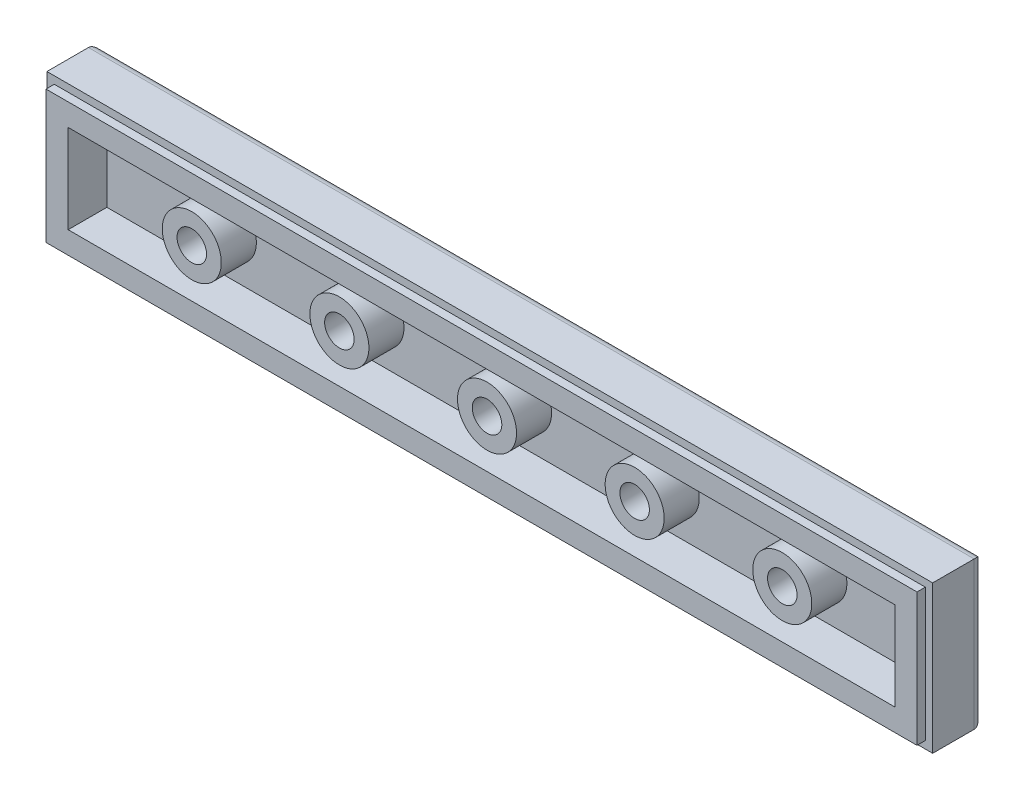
from build123d import *

# Parameters (mm, degrees)
SKIZZE1_W                       = 48
SKIZZE1_H                       = 8
LINEAR_AUSTRAGEN1_DEPTH         = 3.2
SKIZZE2_W                       = 44.8
SKIZZE2_H                       = 4.8
SCHNITT_LINEAR_AUSTRAGEN1_DEPTH = 2.1
SKIZZE3_R                       = 1.6
SKIZZE3_R_2                     = 0.8
LINEAR_AUSTRAGEN2_DEPTH         = 1.9
LINEARES_MUSTER2_COUNT          = 5
LINEARES_MUSTER2_PITCH          = 8
SKIZZE4_OUTSIDE_W               = 59.754
SKIZZE4_OUTSIDE_H               = 19.754
SKIZZE4_OUTSIDE_W_2             = 47.2
SKIZZE4_OUTSIDE_H_2             = 7.2
SCHNITT_LINEAR_AUSTRAGEN2_DEPTH = 0.45
VERRUNDUNG1_R                   = 0.5


with BuildPart() as part:
    # Skizze1 → Linear austragen1 (new body)
    with BuildSketch(Plane.XY):
        with Locations((-24, -4)):
            Rectangle(SKIZZE1_W, SKIZZE1_H)
    extrude(amount=LINEAR_AUSTRAGEN1_DEPTH)

    # Skizze2 → Schnitt-Linear austragen1 (cut)
    with BuildSketch(Plane.XY.offset(3.2)):
        with Locations((-24, -4)):
            Rectangle(SKIZZE2_W, SKIZZE2_H)
    extrude(amount=-SCHNITT_LINEAR_AUSTRAGEN1_DEPTH, mode=Mode.SUBTRACT)

    # Skizze3 → Linear austragen2 (add)
    with BuildSketch(Plane.XY.offset(1.1)):
        with Locations(Location((-7.9, -4, 0), (0, 0, 180))):
            Circle(SKIZZE3_R)
        with Locations(Location((-7.9, -4, 0), (0, 0, 180))):
            Circle(SKIZZE3_R_2, mode=Mode.SUBTRACT)
    linear_austragen2 = extrude(amount=LINEAR_AUSTRAGEN2_DEPTH)

    # Lineares Muster2: Linear austragen2 ×5
    with Locations(*[(-i * LINEARES_MUSTER2_PITCH, 0, 0) for i in range(1, LINEARES_MUSTER2_COUNT)]):
        add(linear_austragen2)

    # Skizze4 outside → Schnitt-Linear austragen2 (cut)
    with BuildSketch(Plane.XY.offset(3.2)):
        with Locations((-24, -4)):
            Rectangle(SKIZZE4_OUTSIDE_W, SKIZZE4_OUTSIDE_H)
        with Locations((-24, -4)):
            Rectangle(SKIZZE4_OUTSIDE_W_2, SKIZZE4_OUTSIDE_H_2, mode=Mode.SUBTRACT)
    extrude(amount=-SCHNITT_LINEAR_AUSTRAGEN2_DEPTH, mode=Mode.SUBTRACT)

    # Verrundung1
    verrundung1_edges = [part.edges().sort_by_distance(p)[0] for p in [
        (-24, -8, 0),
        (-48, -4, 0),
        (-24, 0, 0),
        (0, -4, 0),
    ]]
    fillet(verrundung1_edges, radius=VERRUNDUNG1_R)


solid = part.part
